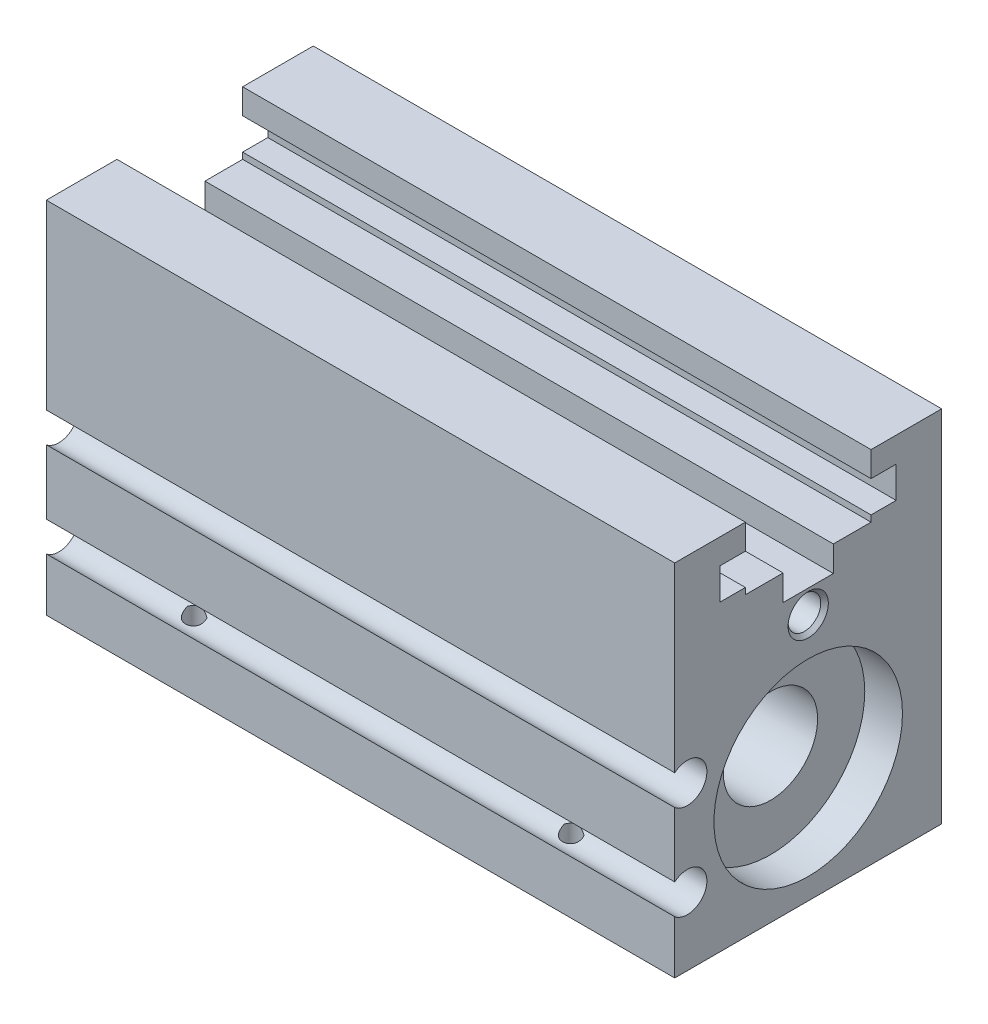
from build123d import *

# Parameters (mm, degrees)
EXTRUDE1_DEPTH     = 63.5
SKETCH2_R          = 9.525
CUT_EXTRUDE1_DEPTH = 3.81
SKETCH3_R          = 1.20269
CUT_EXTRUDE2_DEPTH = 3.048
SKETCH4_R          = 1.20269
CUT_EXTRUDE3_DEPTH = 3.048
CUT_EXTRUDE4_START = 3.81
SKETCH9_R          = 9.525
CUT_EXTRUDE4_DEPTH = 3.81
SKETCH10_W         = 3.81
SKETCH10_H         = 9.3345
SKETCH15_R         = 1.20269
CUT_EXTRUDE5_DEPTH = 3.175
SKETCH16_R         = 1.20269
CUT_EXTRUDE6_DEPTH = 3.175
SKETCH17_R         = 1.20269
CUT_EXTRUDE7_DEPTH = 3.175
SKETCH18_R         = 1.20269
CUT_EXTRUDE8_DEPTH = 3.175
SKETCH20_W         = 50.8
SKETCH20_H         = 4.7625


with BuildPart() as part:
    # Sketch1 → Extrude1 (new body)
    with BuildSketch(Plane(origin=(0, 0, 0), x_dir=(0, 0, -1), z_dir=(1, 0, 0))):
        with BuildLine():
            Line((-13.4874, -18.161), (13.4874, -18.161))
            Line((13.4874, -18.161), (13.4874, 18.161))
            Line((13.4874, 18.161), (6.35, 18.161))
            Line((6.35, 18.161), (6.35, 15.621))
            Line((6.35, 15.621), (8.89, 15.621))
            Line((8.89, 15.621), (8.89, 12.446))
            Line((8.89, 12.446), (6.35, 12.446))
            Line((6.35, 12.446), (6.35, 11.811))
            Line((6.35, 11.811), (2.54, 11.811))
            Line((2.54, 11.811), (2.54, 9.2202))
            Line((2.54, 9.2202), (-2.54, 9.2202))
            Line((-2.54, 9.2202), (-2.54, 11.811))
            Line((-2.54, 11.811), (-6.35, 11.811))
            Line((-6.35, 11.811), (-6.35, 12.446))
            Line((-6.35, 12.446), (-8.89, 12.446))
            Line((-8.89, 12.446), (-8.89, 15.621))
            Line((-8.89, 15.621), (-6.35, 15.621))
            Line((-6.35, 15.621), (-6.35, 18.161))
            Line((-6.35, 18.161), (-13.4874, 18.161))
            Line((-13.4874, 18.161), (-13.4874, -0.206590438))
            ThreePointArc((-13.4874, -0.206590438), (-10.2362, -1.7272), (-13.4874, -3.247809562))
            Line((-13.4874, -3.247809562), (-13.4874, -9.756990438))
            ThreePointArc((-13.4874, -9.756990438), (-10.2362, -11.2776), (-13.4874, -12.798209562))
            Line((-13.4874, -12.798209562), (-13.4874, -18.161))
        make_face()
    extrude(amount=EXTRUDE1_DEPTH)

    # Sketch2 → Cut-Extrude1 (cut)
    with BuildSketch(Plane(origin=(63.5, 0, 0), x_dir=(0, 0, -1), z_dir=(1, 0, 0))):
        with Locations((0, -6.5024)):
            Circle(SKETCH2_R)
    extrude(amount=-CUT_EXTRUDE1_DEPTH, mode=Mode.SUBTRACT)

    # Sketch3 → Cut-Extrude2 (cut)
    with BuildSketch(Plane(origin=(0, 0, 0), x_dir=(0, 0, -1), z_dir=(1, 0, 0))):
        with Locations(Location((10.3251, 8.4582, 0), (0, 0, 180))):
            Circle(SKETCH3_R)
    extrude(amount=CUT_EXTRUDE2_DEPTH, mode=Mode.SUBTRACT)

    # Sketch4 → Cut-Extrude3 (cut)
    with BuildSketch(Plane(origin=(0, 0, 0), x_dir=(0, 0, -1), z_dir=(1, 0, 0))):
        with Locations(Location((-10.3251, -15.367, 0), (0, 0, 180))):
            Circle(SKETCH4_R)
    extrude(amount=CUT_EXTRUDE3_DEPTH, mode=Mode.SUBTRACT)

    # Sketch5 → Cut-Revolve1 (revolve, cut)
    with BuildSketch(Plane.XY.offset(10.3251), mode=Mode.PRIVATE) as cut_revolve1_sk:
        Polygon((0, 8.4582), (0, 9.8552), (0.381, 9.4742), (6.271412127, 9.4742), (6.858, 8.4582), align=None)
    revolve(cut_revolve1_sk.sketch.rotate(Axis((6.858, 8.4582, 10.3251), (-1, 0, 0)), 270), axis=Axis((6.858, 8.4582, 10.3251), (-1, 0, 0)), mode=Mode.SUBTRACT)

    # Sketch6 → Cut-Revolve2 (revolve, cut)
    with BuildSketch(Plane.XY.offset(-10.3251), mode=Mode.PRIVATE) as cut_revolve2_sk:
        Polygon((0, -15.367), (0, -13.97), (0.381, -14.351), (6.271412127, -14.351), (6.858, -15.367), align=None)
    revolve(cut_revolve2_sk.sketch.rotate(Axis((6.858, -15.367, -10.3251), (-1, 0, 0)), 270), axis=Axis((6.858, -15.367, -10.3251), (-1, 0, 0)), mode=Mode.SUBTRACT)

    # Sketch7 → Cut-Revolve3 (revolve, cut)
    with BuildSketch(Plane(origin=(5.715, 0, 0), x_dir=(0, 0, -1), z_dir=(1, 0, 0)), mode=Mode.PRIVATE) as cut_revolve3_sk:
        Polygon((8.9154, 3.8862), (8.9154, 5.8293), (13.0175, 5.8293), (13.4874, 6.2992), (13.4874, 3.8862), align=None)
    revolve(cut_revolve3_sk.sketch.rotate(Axis((5.715, 3.8862, -13.4874), (0, 0, 1)), 270), axis=Axis((5.715, 3.8862, -13.4874), (0, 0, 1)), mode=Mode.SUBTRACT)

    # Sketch8 → Cut-Revolve4 (revolve, cut)
    with BuildSketch(Plane(origin=(54.61, 0, 0), x_dir=(0, 0, -1), z_dir=(1, 0, 0)), mode=Mode.PRIVATE) as cut_revolve4_sk:
        Polygon((8.9154, 3.8862), (8.9154, 5.8293), (13.0175, 5.8293), (13.4874, 6.2992), (13.4874, 3.8862), align=None)
    revolve(cut_revolve4_sk.sketch.rotate(Axis((54.61, 3.8862, -13.4874), (0, 0, 1)), 270), axis=Axis((54.61, 3.8862, -13.4874), (0, 0, 1)), mode=Mode.SUBTRACT)

    # Sketch9 → Cut-Extrude4 (cut)
    with BuildSketch(Plane(origin=(0, 0, 0), x_dir=(0, 0, -1), z_dir=(1, 0, 0)).offset(CUT_EXTRUDE4_START)):
        with Locations((0, -6.5024)):
            Circle(SKETCH9_R)
    extrude(amount=-CUT_EXTRUDE4_DEPTH, mode=Mode.SUBTRACT)

    # Sketch10 → Revolve1 (revolve)
    with BuildSketch(Plane.XY, mode=Mode.PRIVATE) as revolve1_sk:
        with Locations((1.905, -1.83515)):
            Rectangle(SKETCH10_W, SKETCH10_H)
    revolve(revolve1_sk.sketch.rotate(Axis((3.81, -6.5024, 0), (-1, 0, 0)), 270), axis=Axis((3.81, -6.5024, 0), (-1, 0, 0)))

    # Sketch11 → Cut-Revolve5 (revolve, cut)
    with BuildSketch(Plane(origin=(12.7, 0, 0), x_dir=(0, 0, -1), z_dir=(1, 0, 0)), mode=Mode.PRIVATE) as cut_revolve5_sk:
        Polygon((-11.1125, -18.161), (-12.5095, -18.161), (-12.1285, -17.78), (-12.1285, -12.803987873), (-11.1125, -12.2174), align=None)
    revolve(cut_revolve5_sk.sketch.rotate(Axis((12.7, -12.2174, 11.1125), (0, -1, 0)), 180), axis=Axis((12.7, -12.2174, 11.1125), (0, -1, 0)), mode=Mode.SUBTRACT)

    # Sketch12 → Cut-Revolve6 (revolve, cut)
    with BuildSketch(Plane(origin=(50.8, 0, 0), x_dir=(0, 0, -1), z_dir=(1, 0, 0)), mode=Mode.PRIVATE) as cut_revolve6_sk:
        Polygon((-11.1125, -18.161), (-12.5095, -18.161), (-12.1285, -17.78), (-12.1285, -12.803987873), (-11.1125, -12.2174), align=None)
    revolve(cut_revolve6_sk.sketch.rotate(Axis((50.8, -12.2174, 11.1125), (0, -1, 0)), 180), axis=Axis((50.8, -12.2174, 11.1125), (0, -1, 0)), mode=Mode.SUBTRACT)

    # Sketch13 → Cut-Revolve7 (revolve, cut)
    with BuildSketch(Plane(origin=(50.8, 0, 0), x_dir=(0, 0, -1), z_dir=(1, 0, 0)), mode=Mode.PRIVATE) as cut_revolve7_sk:
        Polygon((11.1125, -18.161), (9.7155, -18.161), (10.0965, -17.78), (10.0965, -12.803987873), (11.1125, -12.2174), align=None)
    revolve(cut_revolve7_sk.sketch.rotate(Axis((50.8, -12.2174, -11.1125), (0, -1, 0)), 180), axis=Axis((50.8, -12.2174, -11.1125), (0, -1, 0)), mode=Mode.SUBTRACT)

    # Sketch14 → Cut-Revolve8 (revolve, cut)
    with BuildSketch(Plane(origin=(12.7, 0, 0), x_dir=(0, 0, -1), z_dir=(1, 0, 0)), mode=Mode.PRIVATE) as cut_revolve8_sk:
        Polygon((11.1125, -18.161), (9.7155, -18.161), (10.0965, -17.78), (10.0965, -12.803987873), (11.1125, -12.2174), align=None)
    revolve(cut_revolve8_sk.sketch.rotate(Axis((12.7, -12.2174, -11.1125), (0, -1, 0)), 180), axis=Axis((12.7, -12.2174, -11.1125), (0, -1, 0)), mode=Mode.SUBTRACT)

    # Sketch15 → Cut-Extrude5 (cut)
    with BuildSketch(Plane(origin=(0, -18.161, 0), x_dir=(-1, 0, 0), z_dir=(0, 1, 0))):
        with Locations(Location((-19.05, 11.1125, 0), (0, 0, 90))):
            Circle(SKETCH15_R)
    extrude(amount=CUT_EXTRUDE5_DEPTH, mode=Mode.SUBTRACT)

    # Sketch16 → Cut-Extrude6 (cut)
    with BuildSketch(Plane(origin=(0, -18.161, 0), x_dir=(-1, 0, 0), z_dir=(0, 1, 0))):
        with Locations(Location((-44.45, 11.1125, 0), (0, 0, 90))):
            Circle(SKETCH16_R)
    extrude(amount=CUT_EXTRUDE6_DEPTH, mode=Mode.SUBTRACT)

    # Sketch17 → Cut-Extrude7 (cut)
    with BuildSketch(Plane(origin=(0, -18.161, 0), x_dir=(-1, 0, 0), z_dir=(0, 1, 0))):
        with Locations(Location((-44.45, -11.1125, 0), (0, 0, 90))):
            Circle(SKETCH17_R)
    extrude(amount=CUT_EXTRUDE7_DEPTH, mode=Mode.SUBTRACT)

    # Sketch18 → Cut-Extrude8 (cut)
    with BuildSketch(Plane(origin=(0, -18.161, 0), x_dir=(-1, 0, 0), z_dir=(0, 1, 0))):
        with Locations(Location((-19.05, -11.1125, 0), (0, 0, 90))):
            Circle(SKETCH18_R)
    extrude(amount=CUT_EXTRUDE8_DEPTH, mode=Mode.SUBTRACT)

    # Sketch19 → Cut-Revolve9 (revolve, cut)
    with BuildSketch(Plane.XY, mode=Mode.PRIVATE) as cut_revolve9_sk:
        Polygon((0, 5.360924), (0, 7.392924), (0.381, 7.011924), (3.048, 7.011924), (3.048, 5.360924), align=None)
    revolve(cut_revolve9_sk.sketch.rotate(Axis((3.048, 5.360924, 0), (-1, 0, 0)), 270), axis=Axis((3.048, 5.360924, 0), (-1, 0, 0)), mode=Mode.SUBTRACT)

    # Sketch20 → Cut-Revolve10 (revolve, cut)
    with BuildSketch(Plane.XY, mode=Mode.PRIVATE) as cut_revolve10_sk:
        with Locations((34.29, -4.12115)):
            Rectangle(SKETCH20_W, SKETCH20_H)
    revolve(cut_revolve10_sk.sketch.rotate(Axis((59.69, -6.5024, 0), (-1, 0, 0)), 270), axis=Axis((59.69, -6.5024, 0), (-1, 0, 0)), mode=Mode.SUBTRACT)

    # Sketch21 → Cut-Revolve11 (revolve, cut)
    with BuildSketch(Plane.XY, mode=Mode.PRIVATE) as cut_revolve11_sk:
        Polygon((60.452, 6.8834), (60.452, 8.5344), (63.119, 8.5344), (63.5, 8.9154), (63.5, 6.8834), align=None)
    revolve(cut_revolve11_sk.sketch.rotate(Axis((63.5, 6.8834, 0), (-1, 0, 0)), 270), axis=Axis((63.5, 6.8834, 0), (-1, 0, 0)), mode=Mode.SUBTRACT)


solid = part.part
